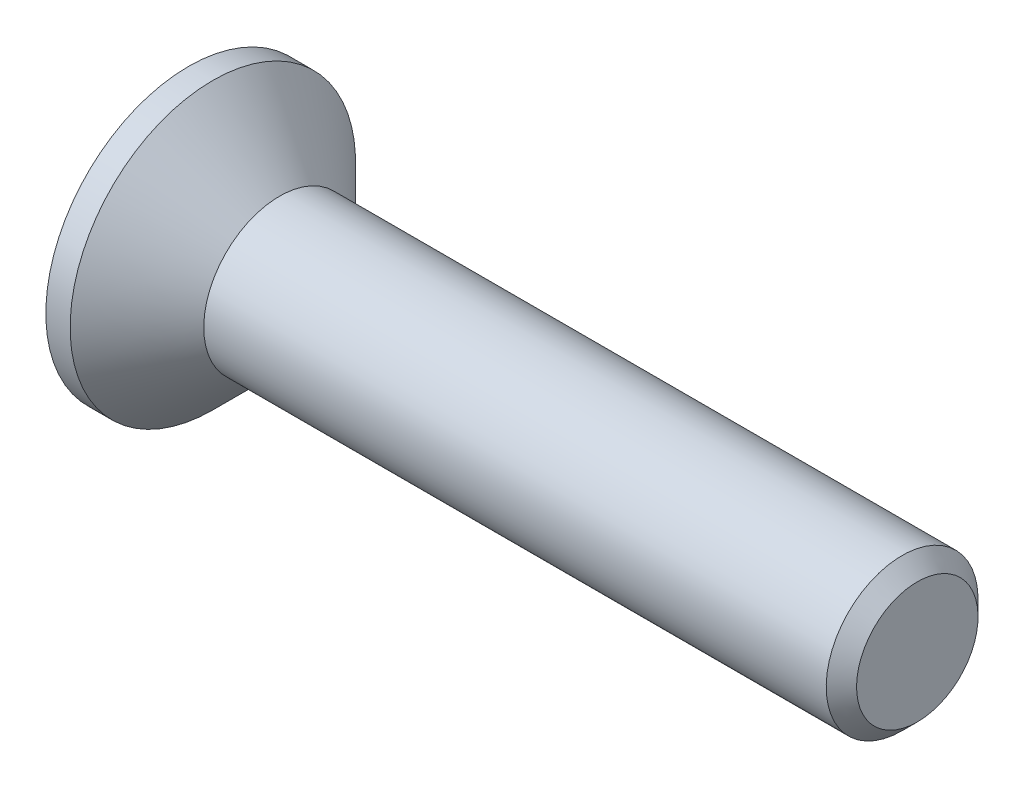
from build123d import *

# Parameters (mm, degrees)
CHAMFER1_SIZE      = 0.25
CUT_EXTRUDE1_DEPTH = 1.25


with BuildPart() as part:
    # Sketch1 → Revolve1 (revolve)
    with BuildSketch(Plane.XY, mode=Mode.PRIVATE) as revolve1_sk:
        Polygon((-1.5, 2.35), (-1.5, 0), (10.5, 0), (10.5, 1.25), (0, 1.25), (-1.1, 2.35), align=None)
    revolve(revolve1_sk.sketch.rotate(Axis((-1.5, 0, 0), (1, 0, 0)), 180), axis=Axis((-1.5, 0, 0), (1, 0, 0)))

    # Chamfer1
    chamfer1_edges = [part.edges().sort_by_distance(p)[0] for p in [
        (10.5, 1.25, 0),
    ]]
    chamfer(chamfer1_edges, length=CHAMFER1_SIZE)

    # Sketch2 → Cut-Extrude1 (cut)
    with BuildSketch(Plane.ZY.offset(1.5)):
        Polygon((-0.34, 1.35), (0.34, 1.35), (0.34, 0.34), (1.35, 0.34), (1.35, -0.34), (0.34, -0.34), (0.34, -1.35), (-0.34, -1.35), (-0.34, -0.34), (-1.35, -0.34), (-1.35, 0.34), (-0.34, 0.34), align=None)
    extrude(amount=-CUT_EXTRUDE1_DEPTH, mode=Mode.SUBTRACT)


solid = part.part
